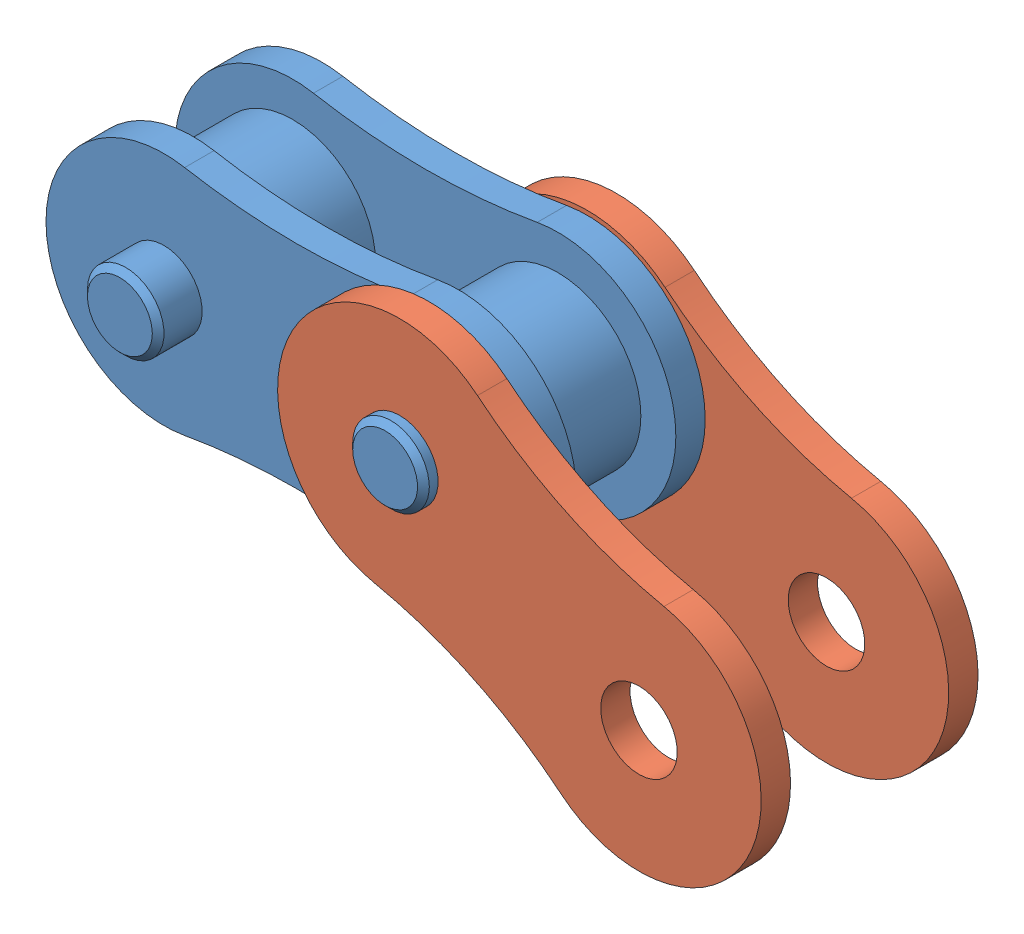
SolidWorks assembly 链节.SLDASM, configuration 28A (file format 3400). Lengths in mm.
Overall size (23.68 13.29 7.42).
3 component instances, 2 part files, 4 mates.
Components (placement in the parent):
- 内链节-1: 内链节.SLDPRT [默认] at (-30.4284 -11.0894 0) size (15.11 7.11 7.42)
- 外链节-1: 外链节.SLDPRT [默认] at (-22.8218 -12.8194 -3.27) x (0.90164 -0.432488 0) z (0 0 1) size (15.37 7.37 0.89)
- 外链节-2: 外链节.SLDPRT [默认] at (-22.8218 -12.8194 2.385) x (0.90164 -0.432488 0) z (0 0 1) size (15.37 7.37 0.89)
Mates (geometry in assembly coordinates):
- 同心1: concentric aligned: cylinder of ?; cylinder of ?
- 重合1: coincident anti-aligned: plane of ?; plane of ?
- 同心2: concentric anti-aligned: cylinder of ?; cylinder of ?
- 重合2: coincident anti-aligned: plane of ?; plane of ?
